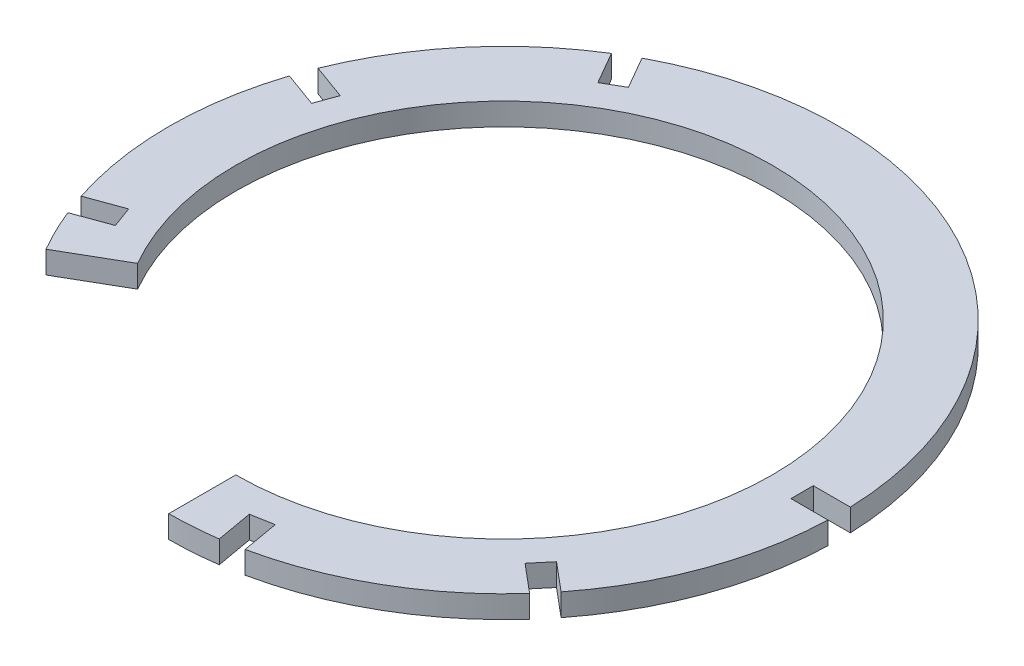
from build123d import *

# Parameters (mm, degrees)
BOSS_EXTRUDE1_DEPTH = 15
SKETCH2_W           = 50
SKETCH2_H           = 15
SKETCH2_W_2         = 55
CUT_EXTRUDE3_DEPTH  = 15


with BuildPart() as part:
    # Sketch1 → Boss-Extrude1 (new body)
    with BuildSketch(Plane(origin=(0, 0, 0), x_dir=(1, 0, 0), z_dir=(0, 1, 0))):
        with BuildLine():
            Line((-194.855715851, -112.5), (-155.884572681, -90))
            ThreePointArc((-155.884572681, -90), (90, 155.884572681), (0, -180))
            Line((0, -180), (0, -225))
            ThreePointArc((0, -225), (112.5, 194.855715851), (-194.855715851, -112.5))
        make_face()
    extrude(amount=BOSS_EXTRUDE1_DEPTH)

    # Sketch2 → Cut-Extrude3 (cut)
    with BuildSketch(Plane(origin=(0, 15, 0), x_dir=(1, 0, 0), z_dir=(0, 1, 0))):
        with Locations((225, 0)):
            Rectangle(SKETCH2_W, SKETCH2_H)
        with Locations((122.5, 0)):
            Rectangle(SKETCH2_W_2, SKETCH2_H)
        Polygon((148.387981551, -134.302855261), (186.690203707, -166.442235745), (196.332017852, -154.951569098), (158.029795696, -122.812188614), align=None)
        Polygon((67.953315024, -66.810156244), (110.085759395, -102.163474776), (119.72757354, -90.67280813), (77.595129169, -55.319489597), align=None)
        Polygon((42.115693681, -195.65918927), (50.798102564, -244.899576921), (36.025986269, -247.504299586), (27.343577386, -198.263911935), align=None)
        Polygon((23.882635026, -92.254375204), (33.433284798, -146.418801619), (18.661168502, -149.023524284), (9.110518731, -94.859097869), align=None)
        Polygon((-41.004809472, -86.02241336), (-68.504809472, -133.653810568), (-81.495190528, -126.153810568), (-53.995190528, -78.52241336), align=None)
        Polygon((-93.504809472, -176.955080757), (-118.504809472, -220.256350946), (-131.495190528, -212.756350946), (-106.495190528, -169.455080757), align=None)
        Polygon((-185.373373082, -75.451723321), (-232.358004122, -92.552730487), (-237.488306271, -78.457341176), (-190.503675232, -61.356334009), align=None)
        Polygon((-86.7056479, -39.539608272), (-138.388742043, -58.350716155), (-143.519044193, -44.255326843), (-91.83595005, -25.44421896), align=None)
        Polygon((-91.83595005, 25.44421896), (-143.519044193, 44.255326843), (-138.388742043, 58.350716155), (-86.7056479, 39.539608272), align=None)
        Polygon((-190.503675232, 61.356334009), (-237.488306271, 78.457341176), (-232.358004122, 92.552730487), (-185.373373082, 75.451723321), align=None)
        Polygon((-53.995190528, 78.52241336), (-81.495190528, 126.153810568), (-68.504809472, 133.653810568), (-41.004809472, 86.02241336), align=None)
        Polygon((-106.495190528, 169.455080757), (-131.495190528, 212.756350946), (-118.504809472, 220.256350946), (-93.504809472, 176.955080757), align=None)
    extrude(amount=-CUT_EXTRUDE3_DEPTH, mode=Mode.SUBTRACT)


solid = part.part
